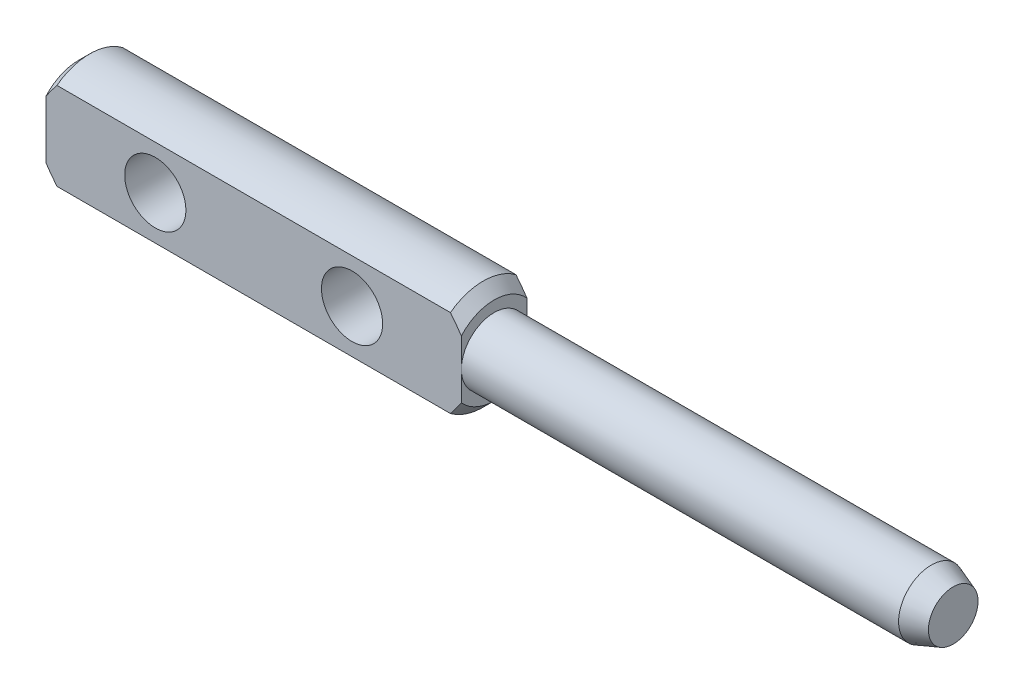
ISO-10303-21;
HEADER;
FILE_DESCRIPTION(('STEP AP214'),'2;1');
FILE_NAME('part.step','',(''),(''),'','','');
FILE_SCHEMA(('AUTOMOTIVE_DESIGN { 1 0 10303 214 1 1 1 1 }'));
ENDSEC;
DATA;
#1=APPLICATION_CONTEXT('core data for automotive mechanical design processes');
#2=APPLICATION_PROTOCOL_DEFINITION('international standard','automotive_design',2000,#1);
#3=PRODUCT_CONTEXT('',#1,'mechanical');
#4=PRODUCT('Part','Part','',(#3));
#5=PRODUCT_RELATED_PRODUCT_CATEGORY('part','',(#4));
#6=PRODUCT_DEFINITION_FORMATION('','',#4);
#7=PRODUCT_DEFINITION_CONTEXT('part definition',#1,'design');
#8=PRODUCT_DEFINITION('design','',#6,#7);
#9=PRODUCT_DEFINITION_SHAPE('','',#8);
#10=(LENGTH_UNIT() NAMED_UNIT(*) SI_UNIT(.MILLI.,.METRE.));
#11=(NAMED_UNIT(*) PLANE_ANGLE_UNIT() SI_UNIT($,.RADIAN.));
#12=(NAMED_UNIT(*) SI_UNIT($,.STERADIAN.) SOLID_ANGLE_UNIT());
#13=UNCERTAINTY_MEASURE_WITH_UNIT(LENGTH_MEASURE(1.E-05),#10,'distance_accuracy_value','');
#14=(GEOMETRIC_REPRESENTATION_CONTEXT(3) GLOBAL_UNCERTAINTY_ASSIGNED_CONTEXT((#13)) GLOBAL_UNIT_ASSIGNED_CONTEXT((#10,
#11,#12)) REPRESENTATION_CONTEXT('',''));
#15=CARTESIAN_POINT('',(0.,0.,0.));
#16=DIRECTION('',(0.,0.,1.));
#17=DIRECTION('',(1.,0.,0.));
#18=AXIS2_PLACEMENT_3D('',#15,#16,#17);
#19=CARTESIAN_POINT('',(0.,0.,0.));
#20=DIRECTION('',(1.,0.,0.));
#21=DIRECTION('',(0.,0.,-1.));
#22=AXIS2_PLACEMENT_3D('',#19,#20,#21);
#23=PLANE('',#22);
#24=DIRECTION('',(0.,1.,0.));
#25=VECTOR('',#24,1.);
#26=CARTESIAN_POINT('',(0.,-2.5,1.5));
#27=LINE('',#26,#25);
#28=CARTESIAN_POINT('',(0.,-1.32287565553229,1.5));
#29=VERTEX_POINT('',#28);
#30=CARTESIAN_POINT('',(0.,1.3228756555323,1.5));
#31=VERTEX_POINT('',#30);
#32=EDGE_CURVE('E159',#29,#31,#27,.T.);
#33=ORIENTED_EDGE('',*,*,#32,.T.);
#34=CARTESIAN_POINT('',(0.,0.,0.));
#35=DIRECTION('',(-1.,0.,0.));
#36=DIRECTION('',(0.,0.,1.));
#37=AXIS2_PLACEMENT_3D('',#34,#35,#36);
#38=CIRCLE('',#37,2.);
#39=CARTESIAN_POINT('',(0.,1.3228756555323,-1.5));
#40=VERTEX_POINT('',#39);
#41=EDGE_CURVE('E12',#31,#40,#38,.T.);
#42=ORIENTED_EDGE('',*,*,#41,.T.);
#43=DIRECTION('',(0.,-1.,0.));
#44=VECTOR('',#43,1.);
#45=CARTESIAN_POINT('',(0.,-2.5,-1.5));
#46=LINE('',#45,#44);
#47=CARTESIAN_POINT('',(0.,-1.3228756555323,-1.5));
#48=VERTEX_POINT('',#47);
#49=EDGE_CURVE('E200',#40,#48,#46,.T.);
#50=ORIENTED_EDGE('',*,*,#49,.T.);
#51=EDGE_CURVE('E43',#48,#29,#38,.T.);
#52=ORIENTED_EDGE('',*,*,#51,.T.);
#53=EDGE_LOOP('',(#33,#42,#50,#52));
#54=FACE_BOUND('',#53,.T.);
#55=ADVANCED_FACE('F36',(#54),#23,.F.);
#56=CARTESIAN_POINT('',(0.5,0.,0.));
#57=DIRECTION('',(1.,0.,0.));
#58=DIRECTION('',(0.,0.,-1.));
#59=AXIS2_PLACEMENT_3D('',#56,#57,#58);
#60=CONICAL_SURFACE('',#59,2.5,0.785398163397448);
#61=CARTESIAN_POINT('',(3.51516268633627,5.30726101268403,1.5));
#62=CARTESIAN_POINT('',(3.41129820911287,5.19932456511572,1.5));
#63=CARTESIAN_POINT('',(3.30755186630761,5.09127425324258,1.5));
#64=CARTESIAN_POINT('',(3.10035188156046,4.87489153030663,1.5));
#65=CARTESIAN_POINT('',(2.9968982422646,4.76655911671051,1.5));
#66=CARTESIAN_POINT('',(2.68699795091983,4.4409908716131,1.5));
#67=CARTESIAN_POINT('',(2.48107825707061,4.22325282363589,1.5));
#68=CARTESIAN_POINT('',(2.07285908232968,3.78735533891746,1.5));
#69=CARTESIAN_POINT('',(1.87054417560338,3.56921041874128,1.5));
#70=CARTESIAN_POINT('',(1.5697300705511,3.2395911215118,1.5));
#71=CARTESIAN_POINT('',(1.4699081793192,3.12932498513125,1.5));
#72=CARTESIAN_POINT('',(1.27145616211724,2.9077267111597,1.5));
#73=CARTESIAN_POINT('',(1.17282600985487,2.79639459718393,1.5));
#74=CARTESIAN_POINT('',(1.00543413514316,2.60463800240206,1.5));
#75=CARTESIAN_POINT('',(0.936267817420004,2.52456708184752,1.5));
#76=CARTESIAN_POINT('',(0.798998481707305,2.36350815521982,1.5));
#77=CARTESIAN_POINT('',(0.7308955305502,2.28252009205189,1.5));
#78=CARTESIAN_POINT('',(0.595778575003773,2.11900885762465,1.5));
#79=CARTESIAN_POINT('',(0.528771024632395,2.03648033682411,1.5));
#80=CARTESIAN_POINT('',(0.396669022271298,1.86991949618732,1.5));
#81=CARTESIAN_POINT('',(0.331574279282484,1.78588740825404,1.5));
#82=CARTESIAN_POINT('',(0.203522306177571,1.6151567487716,1.5));
#83=CARTESIAN_POINT('',(0.140586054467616,1.52844234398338,1.5));
#84=CARTESIAN_POINT('',(0.0185337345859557,1.3522307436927,1.5));
#85=CARTESIAN_POINT('',(-0.0405793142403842,1.2627314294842,1.5));
#86=CARTESIAN_POINT('',(-0.152775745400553,1.08045990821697,1.5));
#87=CARTESIAN_POINT('',(-0.205881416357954,0.987701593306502,1.5));
#88=CARTESIAN_POINT('',(-0.303093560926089,0.79758711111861,1.5));
#89=CARTESIAN_POINT('',(-0.347216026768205,0.700239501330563,1.5));
#90=CARTESIAN_POINT('',(-0.403299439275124,0.549256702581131,1.5));
#91=CARTESIAN_POINT('',(-0.42043059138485,0.497552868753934,1.5));
#92=CARTESIAN_POINT('',(-0.450219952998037,0.392856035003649,1.5));
#93=CARTESIAN_POINT('',(-0.462878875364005,0.339863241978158,1.5));
#94=CARTESIAN_POINT('',(-0.482866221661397,0.233262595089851,1.5));
#95=CARTESIAN_POINT('',(-0.490232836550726,0.179662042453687,1.5));
#96=CARTESIAN_POINT('',(-0.499231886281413,0.0719778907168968,1.5));
#97=CARTESIAN_POINT('',(-0.500865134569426,0.0178943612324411,1.5));
#98=CARTESIAN_POINT('',(-0.498261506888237,-0.0902887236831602,1.5));
#99=CARTESIAN_POINT('',(-0.494007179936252,-0.144387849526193,1.5));
#100=CARTESIAN_POINT('',(-0.479938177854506,-0.251852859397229,1.5));
#101=CARTESIAN_POINT('',(-0.470122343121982,-0.305218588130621,1.5));
#102=CARTESIAN_POINT('',(-0.445517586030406,-0.411215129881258,1.5));
#103=CARTESIAN_POINT('',(-0.430689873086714,-0.463836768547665,1.5));
#104=CARTESIAN_POINT('',(-0.396911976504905,-0.567720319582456,1.5));
#105=CARTESIAN_POINT('',(-0.377961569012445,-0.618982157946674,1.5));
#106=CARTESIAN_POINT('',(-0.332968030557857,-0.729371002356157,1.5));
#107=CARTESIAN_POINT('',(-0.306261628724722,-0.788225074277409,1.5));
#108=CARTESIAN_POINT('',(-0.249281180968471,-0.904194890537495,1.5));
#109=CARTESIAN_POINT('',(-0.219005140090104,-0.961309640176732,1.5));
#110=CARTESIAN_POINT('',(-0.155680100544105,-1.07410361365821,1.5));
#111=CARTESIAN_POINT('',(-0.122626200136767,-1.12978006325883,1.5));
#112=CARTESIAN_POINT('',(-0.0544093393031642,-1.23983114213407,1.5));
#113=CARTESIAN_POINT('',(-0.019245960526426,-1.29420551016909,1.5));
#114=CARTESIAN_POINT('',(0.0894442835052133,-1.45683639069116,1.5));
#115=CARTESIAN_POINT('',(0.165477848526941,-1.56341309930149,1.5));
#116=CARTESIAN_POINT('',(0.321582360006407,-1.77330825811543,1.5));
#117=CARTESIAN_POINT('',(0.401648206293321,-1.87663056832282,1.5));
#118=CARTESIAN_POINT('',(0.543618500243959,-2.05477163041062,1.5));
#119=CARTESIAN_POINT('',(0.604899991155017,-2.13008914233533,1.5));
#120=CARTESIAN_POINT('',(0.728642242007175,-2.27974903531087,1.5));
#121=CARTESIAN_POINT('',(0.791103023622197,-2.354091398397,1.5));
#122=CARTESIAN_POINT('',(0.97986365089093,-2.57598067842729,1.5));
#123=CARTESIAN_POINT('',(1.10752448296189,-2.72236841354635,1.5));
#124=CARTESIAN_POINT('',(1.36529460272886,-3.01325594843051,1.5));
#125=CARTESIAN_POINT('',(1.49540651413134,-3.15775340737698,1.5));
#126=CARTESIAN_POINT('',(1.75719842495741,-3.44529728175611,1.5));
#127=CARTESIAN_POINT('',(1.88887829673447,-3.58834381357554,1.5));
#128=CARTESIAN_POINT('',(2.14434448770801,-3.86368160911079,1.5));
#129=CARTESIAN_POINT('',(2.26805709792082,-3.99604140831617,1.5));
#130=CARTESIAN_POINT('',(2.51621722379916,-4.2600760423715,1.5));
#131=CARTESIAN_POINT('',(2.64066475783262,-4.3917508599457,1.5));
#132=CARTESIAN_POINT('',(2.88987319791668,-4.65430649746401,1.5));
#133=CARTESIAN_POINT('',(3.0146329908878,-4.7851883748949,1.5));
#134=CARTESIAN_POINT('',(3.26459391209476,-5.04652082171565,1.5));
#135=CARTESIAN_POINT('',(3.38979502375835,-5.17697140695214,1.5));
#136=CARTESIAN_POINT('',(3.51516268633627,-5.30726101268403,1.5));
#137=B_SPLINE_CURVE_WITH_KNOTS('',3,(#61,#62,#63,#64,#65,#66,#67,#68,#69,#70,#71,#72,#73,#74,
#75,#76,#77,#78,#79,#80,#81,#82,#83,#84,#85,#86,#87,#88,#89,#90,#91,#92,#93,#94,#95,#96,#97,#98,
#99,#100,#101,#102,#103,#104,#105,#106,#107,#108,#109,#110,#111,#112,#113,#114,#115,#116,#117,
#118,#119,#120,#121,#122,#123,#124,#125,#126,#127,#128,#129,#130,#131,#132,#133,#134,#135,#136),
.UNSPECIFIED.,.F.,.F.,(4,2,2,2,2,2,2,2,2,2,2,2,2,2,2,2,2,2,2,2,2,2,2,2,2,2,2,2,2,2,2,2,2,2,2,2,
2,4),(0.,0.449380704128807,0.898765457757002,1.79782163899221,2.69035548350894,3.13656410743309,
3.58276286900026,3.90017989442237,4.21761678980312,4.53651459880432,4.85536363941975,
5.1767345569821,5.49835625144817,5.81874255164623,6.13855340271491,6.30179762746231,
6.46501581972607,6.6270440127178,6.78904921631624,6.95153563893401,7.11405595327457,
7.27786408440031,7.44168111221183,7.6354096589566,7.82924699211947,8.02343385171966,
8.21765935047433,8.61022782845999,9.00231166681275,9.29359301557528,9.58487972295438,
10.1675355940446,10.7508552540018,11.3341277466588,11.8776457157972,12.4211773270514,
12.9636295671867,13.5060616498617),.UNSPECIFIED.);
#138=CARTESIAN_POINT('',(0.5,2.,1.5));
#139=VERTEX_POINT('',#138);
#140=EDGE_CURVE('E113',#139,#31,#137,.T.);
#141=ORIENTED_EDGE('',*,*,#140,.F.);
#142=CARTESIAN_POINT('',(0.5,0.,0.));
#143=DIRECTION('',(-1.,0.,0.));
#144=DIRECTION('',(0.,0.,1.));
#145=AXIS2_PLACEMENT_3D('',#142,#143,#144);
#146=CIRCLE('',#145,2.5);
#147=CARTESIAN_POINT('',(0.5,2.,-1.5));
#148=VERTEX_POINT('',#147);
#149=EDGE_CURVE('E141',#139,#148,#146,.T.);
#150=ORIENTED_EDGE('',*,*,#149,.T.);
#151=CARTESIAN_POINT('',(3.51516268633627,-5.30726101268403,-1.5));
#152=CARTESIAN_POINT('',(3.41129820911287,-5.19932456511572,-1.5));
#153=CARTESIAN_POINT('',(3.30755186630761,-5.09127425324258,-1.5));
#154=CARTESIAN_POINT('',(3.10035188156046,-4.87489153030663,-1.5));
#155=CARTESIAN_POINT('',(2.9968982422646,-4.76655911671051,-1.5));
#156=CARTESIAN_POINT('',(2.68699795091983,-4.4409908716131,-1.5));
#157=CARTESIAN_POINT('',(2.48107825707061,-4.22325282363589,-1.5));
#158=CARTESIAN_POINT('',(2.07285908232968,-3.78735533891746,-1.5));
#159=CARTESIAN_POINT('',(1.87054417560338,-3.56921041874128,-1.5));
#160=CARTESIAN_POINT('',(1.5697300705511,-3.2395911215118,-1.5));
#161=CARTESIAN_POINT('',(1.4699081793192,-3.12932498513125,-1.5));
#162=CARTESIAN_POINT('',(1.27145616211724,-2.9077267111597,-1.5));
#163=CARTESIAN_POINT('',(1.17282600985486,-2.79639459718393,-1.5));
#164=CARTESIAN_POINT('',(1.00543413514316,-2.60463800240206,-1.5));
#165=CARTESIAN_POINT('',(0.936267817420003,-2.52456708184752,-1.5));
#166=CARTESIAN_POINT('',(0.798998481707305,-2.36350815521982,-1.5));
#167=CARTESIAN_POINT('',(0.730895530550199,-2.28252009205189,-1.5));
#168=CARTESIAN_POINT('',(0.595778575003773,-2.11900885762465,-1.5));
#169=CARTESIAN_POINT('',(0.528771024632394,-2.03648033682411,-1.5));
#170=CARTESIAN_POINT('',(0.396669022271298,-1.86991949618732,-1.5));
#171=CARTESIAN_POINT('',(0.331574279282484,-1.78588740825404,-1.5));
#172=CARTESIAN_POINT('',(0.203522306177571,-1.6151567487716,-1.5));
#173=CARTESIAN_POINT('',(0.140586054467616,-1.52844234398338,-1.5));
#174=CARTESIAN_POINT('',(0.0185337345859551,-1.3522307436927,-1.5));
#175=CARTESIAN_POINT('',(-0.0405793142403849,-1.2627314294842,-1.5));
#176=CARTESIAN_POINT('',(-0.152775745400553,-1.08045990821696,-1.5));
#177=CARTESIAN_POINT('',(-0.205881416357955,-0.987701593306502,-1.5));
#178=CARTESIAN_POINT('',(-0.303093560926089,-0.79758711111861,-1.5));
#179=CARTESIAN_POINT('',(-0.347216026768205,-0.700239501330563,-1.5));
#180=CARTESIAN_POINT('',(-0.403299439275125,-0.549256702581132,-1.5));
#181=CARTESIAN_POINT('',(-0.42043059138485,-0.497552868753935,-1.5));
#182=CARTESIAN_POINT('',(-0.450219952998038,-0.392856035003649,-1.5));
#183=CARTESIAN_POINT('',(-0.462878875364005,-0.339863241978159,-1.5));
#184=CARTESIAN_POINT('',(-0.482866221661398,-0.233262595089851,-1.5));
#185=CARTESIAN_POINT('',(-0.490232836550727,-0.179662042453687,-1.5));
#186=CARTESIAN_POINT('',(-0.499231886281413,-0.0719778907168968,-1.5));
#187=CARTESIAN_POINT('',(-0.500865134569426,-0.0178943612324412,-1.5));
#188=CARTESIAN_POINT('',(-0.498261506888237,0.0902887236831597,-1.5));
#189=CARTESIAN_POINT('',(-0.494007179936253,0.144387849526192,-1.5));
#190=CARTESIAN_POINT('',(-0.479938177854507,0.251852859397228,-1.5));
#191=CARTESIAN_POINT('',(-0.470122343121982,0.30521858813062,-1.5));
#192=CARTESIAN_POINT('',(-0.445517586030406,0.411215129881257,-1.5));
#193=CARTESIAN_POINT('',(-0.430689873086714,0.463836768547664,-1.5));
#194=CARTESIAN_POINT('',(-0.396911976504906,0.567720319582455,-1.5));
#195=CARTESIAN_POINT('',(-0.377961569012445,0.618982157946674,-1.5));
#196=CARTESIAN_POINT('',(-0.332968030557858,0.729371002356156,-1.5));
#197=CARTESIAN_POINT('',(-0.306261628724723,0.788225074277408,-1.5));
#198=CARTESIAN_POINT('',(-0.249281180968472,0.904194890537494,-1.5));
#199=CARTESIAN_POINT('',(-0.219005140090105,0.961309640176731,-1.5));
#200=CARTESIAN_POINT('',(-0.155680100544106,1.07410361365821,-1.5));
#201=CARTESIAN_POINT('',(-0.122626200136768,1.12978006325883,-1.5));
#202=CARTESIAN_POINT('',(-0.054409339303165,1.23983114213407,-1.5));
#203=CARTESIAN_POINT('',(-0.0192459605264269,1.29420551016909,-1.5));
#204=CARTESIAN_POINT('',(0.0894442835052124,1.45683639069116,-1.5));
#205=CARTESIAN_POINT('',(0.16547784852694,1.56341309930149,-1.5));
#206=CARTESIAN_POINT('',(0.321582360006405,1.77330825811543,-1.5));
#207=CARTESIAN_POINT('',(0.401648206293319,1.87663056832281,-1.5));
#208=CARTESIAN_POINT('',(0.543618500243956,2.05477163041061,-1.5));
#209=CARTESIAN_POINT('',(0.604899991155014,2.13008914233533,-1.5));
#210=CARTESIAN_POINT('',(0.728642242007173,2.27974903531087,-1.5));
#211=CARTESIAN_POINT('',(0.791103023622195,2.354091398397,-1.5));
#212=CARTESIAN_POINT('',(0.979863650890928,2.57598067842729,-1.5));
#213=CARTESIAN_POINT('',(1.10752448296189,2.72236841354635,-1.5));
#214=CARTESIAN_POINT('',(1.36529460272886,3.01325594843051,-1.5));
#215=CARTESIAN_POINT('',(1.49540651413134,3.15775340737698,-1.5));
#216=CARTESIAN_POINT('',(1.75719842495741,3.44529728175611,-1.5));
#217=CARTESIAN_POINT('',(1.88887829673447,3.58834381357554,-1.5));
#218=CARTESIAN_POINT('',(2.14434448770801,3.86368160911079,-1.5));
#219=CARTESIAN_POINT('',(2.26805709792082,3.99604140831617,-1.5));
#220=CARTESIAN_POINT('',(2.51621722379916,4.2600760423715,-1.5));
#221=CARTESIAN_POINT('',(2.64066475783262,4.3917508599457,-1.5));
#222=CARTESIAN_POINT('',(2.88987319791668,4.65430649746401,-1.5));
#223=CARTESIAN_POINT('',(3.0146329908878,4.7851883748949,-1.5));
#224=CARTESIAN_POINT('',(3.26459391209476,5.04652082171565,-1.5));
#225=CARTESIAN_POINT('',(3.38979502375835,5.17697140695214,-1.5));
#226=CARTESIAN_POINT('',(3.51516268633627,5.30726101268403,-1.5));
#227=B_SPLINE_CURVE_WITH_KNOTS('',3,(#151,#152,#153,#154,#155,#156,#157,#158,#159,#160,#161,
#162,#163,#164,#165,#166,#167,#168,#169,#170,#171,#172,#173,#174,#175,#176,#177,#178,#179,#180,
#181,#182,#183,#184,#185,#186,#187,#188,#189,#190,#191,#192,#193,#194,#195,#196,#197,#198,#199,
#200,#201,#202,#203,#204,#205,#206,#207,#208,#209,#210,#211,#212,#213,#214,#215,#216,#217,#218,
#219,#220,#221,#222,#223,#224,#225,#226),.UNSPECIFIED.,.F.,.F.,(4,2,2,2,2,2,2,2,2,2,2,2,2,2,2,2,
2,2,2,2,2,2,2,2,2,2,2,2,2,2,2,2,2,2,2,2,2,4),(0.,0.449380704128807,0.898765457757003,
1.79782163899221,2.69035548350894,3.13656410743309,3.58276286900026,3.90017989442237,
4.21761678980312,4.53651459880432,4.85536363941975,5.1767345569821,5.49835625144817,
5.81874255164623,6.1385534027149,6.30179762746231,6.46501581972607,6.6270440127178,
6.78904921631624,6.951535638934,7.11405595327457,7.27786408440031,7.44168111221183,
7.6354096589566,7.82924699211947,8.02343385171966,8.21765935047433,8.61022782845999,
9.00231166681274,9.29359301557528,9.58487972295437,10.1675355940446,10.7508552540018,
11.3341277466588,11.8776457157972,12.4211773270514,12.9636295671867,13.5060616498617),.UNSPECIFIED.);
#228=EDGE_CURVE('E203',#40,#148,#227,.T.);
#229=ORIENTED_EDGE('',*,*,#228,.F.);
#230=ORIENTED_EDGE('',*,*,#41,.F.);
#231=EDGE_LOOP('',(#141,#150,#229,#230));
#232=FACE_BOUND('',#231,.T.);
#233=ADVANCED_FACE('F193',(#232),#60,.T.);
#234=CARTESIAN_POINT('',(0.5,-2.,1.5));
#235=VERTEX_POINT('',#234);
#236=EDGE_CURVE('E154',#29,#235,#137,.T.);
#237=ORIENTED_EDGE('',*,*,#236,.F.);
#238=ORIENTED_EDGE('',*,*,#51,.F.);
#239=CARTESIAN_POINT('',(0.5,-2.,-1.5));
#240=VERTEX_POINT('',#239);
#241=EDGE_CURVE('E155',#240,#48,#227,.T.);
#242=ORIENTED_EDGE('',*,*,#241,.F.);
#243=EDGE_CURVE('E140',#240,#235,#146,.T.);
#244=ORIENTED_EDGE('',*,*,#243,.T.);
#245=EDGE_LOOP('',(#237,#238,#242,#244));
#246=FACE_BOUND('',#245,.T.);
#247=ADVANCED_FACE('F152',(#246),#60,.T.);
#248=CARTESIAN_POINT('',(0.,0.,0.));
#249=DIRECTION('',(-1.,0.,0.));
#250=DIRECTION('',(0.,0.,1.));
#251=AXIS2_PLACEMENT_3D('',#248,#249,#250);
#252=CYLINDRICAL_SURFACE('',#251,2.5);
#253=CARTESIAN_POINT('',(18.5,0.,0.));
#254=DIRECTION('',(-1.,0.,0.));
#255=DIRECTION('',(0.,0.,1.));
#256=AXIS2_PLACEMENT_3D('',#253,#254,#255);
#257=CIRCLE('',#256,2.5);
#258=CARTESIAN_POINT('',(18.5,-2.,-1.5));
#259=VERTEX_POINT('',#258);
#260=CARTESIAN_POINT('',(18.4999999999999,-2.00000000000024,1.5));
#261=VERTEX_POINT('',#260);
#262=EDGE_CURVE('E134',#259,#261,#257,.T.);
#263=ORIENTED_EDGE('',*,*,#262,.T.);
#264=DIRECTION('',(-1.,0.,0.));
#265=VECTOR('',#264,1.);
#266=CARTESIAN_POINT('',(0.,-2.,1.5));
#267=LINE('',#266,#265);
#268=EDGE_CURVE('E109',#235,#261,#267,.F.);
#269=ORIENTED_EDGE('',*,*,#268,.F.);
#270=ORIENTED_EDGE('',*,*,#243,.F.);
#271=DIRECTION('',(-1.,0.,0.));
#272=VECTOR('',#271,1.);
#273=CARTESIAN_POINT('',(0.,-2.,-1.5));
#274=LINE('',#273,#272);
#275=EDGE_CURVE('E215',#259,#240,#274,.T.);
#276=ORIENTED_EDGE('',*,*,#275,.F.);
#277=EDGE_LOOP('',(#263,#269,#270,#276));
#278=FACE_BOUND('',#277,.T.);
#279=ADVANCED_FACE('F162',(#278),#252,.T.);
#280=DIRECTION('',(-1.,0.,0.));
#281=VECTOR('',#280,1.);
#282=CARTESIAN_POINT('',(0.,2.,-1.5));
#283=LINE('',#282,#281);
#284=CARTESIAN_POINT('',(18.4999999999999,2.00000000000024,-1.5));
#285=VERTEX_POINT('',#284);
#286=EDGE_CURVE('E206',#148,#285,#283,.F.);
#287=ORIENTED_EDGE('',*,*,#286,.F.);
#288=ORIENTED_EDGE('',*,*,#149,.F.);
#289=DIRECTION('',(-1.,0.,0.));
#290=VECTOR('',#289,1.);
#291=CARTESIAN_POINT('',(0.,2.,1.5));
#292=LINE('',#291,#290);
#293=CARTESIAN_POINT('',(18.5,2.,1.5));
#294=VERTEX_POINT('',#293);
#295=EDGE_CURVE('E208',#294,#139,#292,.T.);
#296=ORIENTED_EDGE('',*,*,#295,.F.);
#297=EDGE_CURVE('E139',#294,#285,#257,.T.);
#298=ORIENTED_EDGE('',*,*,#297,.T.);
#299=EDGE_LOOP('',(#287,#288,#296,#298));
#300=FACE_BOUND('',#299,.T.);
#301=ADVANCED_FACE('F241',(#300),#252,.T.);
#302=CARTESIAN_POINT('',(19.,0.,0.));
#303=DIRECTION('',(-1.,0.,0.));
#304=DIRECTION('',(0.,0.,1.));
#305=AXIS2_PLACEMENT_3D('',#302,#303,#304);
#306=CONICAL_SURFACE('',#305,2.,0.785398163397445);
#307=CARTESIAN_POINT('',(15.4848373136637,-5.307261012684,1.5));
#308=CARTESIAN_POINT('',(15.5887017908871,-5.19932456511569,1.5));
#309=CARTESIAN_POINT('',(15.6924481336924,-5.09127425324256,1.5));
#310=CARTESIAN_POINT('',(15.8996481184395,-4.87489153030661,1.5));
#311=CARTESIAN_POINT('',(16.0031017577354,-4.76655911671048,1.5));
#312=CARTESIAN_POINT('',(16.3130020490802,-4.44099087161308,1.5));
#313=CARTESIAN_POINT('',(16.5189217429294,-4.22325282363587,1.5));
#314=CARTESIAN_POINT('',(16.9271409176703,-3.78735533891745,1.5));
#315=CARTESIAN_POINT('',(17.1294558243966,-3.56921041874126,1.5));
#316=CARTESIAN_POINT('',(17.4302699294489,-3.23959112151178,1.5));
#317=CARTESIAN_POINT('',(17.5300918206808,-3.12932498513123,1.5));
#318=CARTESIAN_POINT('',(17.7285438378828,-2.90772671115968,1.5));
#319=CARTESIAN_POINT('',(17.8271739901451,-2.79639459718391,1.5));
#320=CARTESIAN_POINT('',(17.9945658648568,-2.60463800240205,1.5));
#321=CARTESIAN_POINT('',(18.06373218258,-2.52456708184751,1.5));
#322=CARTESIAN_POINT('',(18.2010015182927,-2.36350815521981,1.5));
#323=CARTESIAN_POINT('',(18.2691044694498,-2.28252009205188,1.5));
#324=CARTESIAN_POINT('',(18.4042214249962,-2.11900885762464,1.5));
#325=CARTESIAN_POINT('',(18.4712289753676,-2.0364803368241,1.5));
#326=CARTESIAN_POINT('',(18.6033309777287,-1.86991949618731,1.5));
#327=CARTESIAN_POINT('',(18.6684257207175,-1.78588740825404,1.5));
#328=CARTESIAN_POINT('',(18.7964776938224,-1.6151567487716,1.5));
#329=CARTESIAN_POINT('',(18.8594139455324,-1.52844234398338,1.5));
#330=CARTESIAN_POINT('',(18.981466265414,-1.3522307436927,1.5));
#331=CARTESIAN_POINT('',(19.0405793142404,-1.2627314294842,1.5));
#332=CARTESIAN_POINT('',(19.1527757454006,-1.08045990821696,1.5));
#333=CARTESIAN_POINT('',(19.205881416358,-0.987701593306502,1.5));
#334=CARTESIAN_POINT('',(19.3030935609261,-0.797587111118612,1.5));
#335=CARTESIAN_POINT('',(19.3472160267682,-0.700239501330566,1.5));
#336=CARTESIAN_POINT('',(19.4032994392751,-0.549256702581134,1.5));
#337=CARTESIAN_POINT('',(19.4204305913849,-0.497552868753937,1.5));
#338=CARTESIAN_POINT('',(19.450219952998,-0.392856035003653,1.5));
#339=CARTESIAN_POINT('',(19.462878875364,-0.339863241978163,1.5));
#340=CARTESIAN_POINT('',(19.4828662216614,-0.233262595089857,1.5));
#341=CARTESIAN_POINT('',(19.4902328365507,-0.179662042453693,1.5));
#342=CARTESIAN_POINT('',(19.4992318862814,-0.0719778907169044,1.5));
#343=CARTESIAN_POINT('',(19.5008651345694,-0.0178943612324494,1.5));
#344=CARTESIAN_POINT('',(19.4982615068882,0.0902887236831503,1.5));
#345=CARTESIAN_POINT('',(19.4940071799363,0.144387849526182,1.5));
#346=CARTESIAN_POINT('',(19.4799381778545,0.251852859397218,1.5));
#347=CARTESIAN_POINT('',(19.470122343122,0.30521858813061,1.5));
#348=CARTESIAN_POINT('',(19.4455175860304,0.411215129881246,1.5));
#349=CARTESIAN_POINT('',(19.4306898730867,0.463836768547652,1.5));
#350=CARTESIAN_POINT('',(19.3969119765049,0.567720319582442,1.5));
#351=CARTESIAN_POINT('',(19.3779615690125,0.618982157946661,1.5));
#352=CARTESIAN_POINT('',(19.3329680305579,0.729371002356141,1.5));
#353=CARTESIAN_POINT('',(19.3062616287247,0.788225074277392,1.5));
#354=CARTESIAN_POINT('',(19.2492811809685,0.904194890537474,1.5));
#355=CARTESIAN_POINT('',(19.2190051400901,0.961309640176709,1.5));
#356=CARTESIAN_POINT('',(19.1556801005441,1.07410361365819,1.5));
#357=CARTESIAN_POINT('',(19.1226262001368,1.1297800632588,1.5));
#358=CARTESIAN_POINT('',(19.0544093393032,1.23983114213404,1.5));
#359=CARTESIAN_POINT('',(19.0192459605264,1.29420551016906,1.5));
#360=CARTESIAN_POINT('',(18.9105557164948,1.45683639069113,1.5));
#361=CARTESIAN_POINT('',(18.8345221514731,1.56341309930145,1.5));
#362=CARTESIAN_POINT('',(18.6784176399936,1.77330825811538,1.5));
#363=CARTESIAN_POINT('',(18.5983517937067,1.87663056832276,1.5));
#364=CARTESIAN_POINT('',(18.4563814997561,2.05477163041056,1.5));
#365=CARTESIAN_POINT('',(18.395100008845,2.13008914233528,1.5));
#366=CARTESIAN_POINT('',(18.2713577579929,2.27974903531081,1.5));
#367=CARTESIAN_POINT('',(18.2088969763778,2.35409139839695,1.5));
#368=CARTESIAN_POINT('',(18.0201363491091,2.57598067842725,1.5));
#369=CARTESIAN_POINT('',(17.8924755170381,2.72236841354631,1.5));
#370=CARTESIAN_POINT('',(17.6347053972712,3.01325594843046,1.5));
#371=CARTESIAN_POINT('',(17.5045934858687,3.15775340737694,1.5));
#372=CARTESIAN_POINT('',(17.2428015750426,3.44529728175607,1.5));
#373=CARTESIAN_POINT('',(17.1111217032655,3.58834381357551,1.5));
#374=CARTESIAN_POINT('',(16.855655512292,3.86368160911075,1.5));
#375=CARTESIAN_POINT('',(16.7319429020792,3.99604140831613,1.5));
#376=CARTESIAN_POINT('',(16.4837827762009,4.26007604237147,1.5));
#377=CARTESIAN_POINT('',(16.3593352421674,4.39175085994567,1.5));
#378=CARTESIAN_POINT('',(16.1101268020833,4.65430649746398,1.5));
#379=CARTESIAN_POINT('',(15.9853670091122,4.78518837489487,1.5));
#380=CARTESIAN_POINT('',(15.7354060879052,5.04652082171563,1.5));
#381=CARTESIAN_POINT('',(15.6102049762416,5.17697140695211,1.5));
#382=CARTESIAN_POINT('',(15.4848373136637,5.307261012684,1.5));
#383=B_SPLINE_CURVE_WITH_KNOTS('',3,(#307,#308,#309,#310,#311,#312,#313,#314,#315,#316,#317,
#318,#319,#320,#321,#322,#323,#324,#325,#326,#327,#328,#329,#330,#331,#332,#333,#334,#335,#336,
#337,#338,#339,#340,#341,#342,#343,#344,#345,#346,#347,#348,#349,#350,#351,#352,#353,#354,#355,
#356,#357,#358,#359,#360,#361,#362,#363,#364,#365,#366,#367,#368,#369,#370,#371,#372,#373,#374,
#375,#376,#377,#378,#379,#380,#381,#382),.UNSPECIFIED.,.F.,.F.,(4,2,2,2,2,2,2,2,2,2,2,2,2,2,2,2,
2,2,2,2,2,2,2,2,2,2,2,2,2,2,2,2,2,2,2,2,2,4),(0.,0.449380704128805,0.898765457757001,
1.79782163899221,2.69035548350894,3.13656410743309,3.58276286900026,3.90017989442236,
4.21761678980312,4.53651459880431,4.85536363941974,5.17673455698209,5.49835625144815,
5.81874255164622,6.13855340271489,6.30179762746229,6.46501581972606,6.62704401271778,
6.78904921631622,6.95153563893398,7.11405595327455,7.27786408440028,7.4416811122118,
7.63540965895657,7.82924699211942,8.02343385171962,8.21765935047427,8.61022782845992,
9.00231166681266,9.2935930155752,9.5848797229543,10.1675355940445,10.7508552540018,
11.3341277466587,11.8776457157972,12.4211773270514,12.9636295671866,13.5060616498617),.UNSPECIFIED.);
#384=CARTESIAN_POINT('',(19.,-1.32287565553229,1.5));
#385=VERTEX_POINT('',#384);
#386=EDGE_CURVE('E105',#261,#385,#383,.T.);
#387=ORIENTED_EDGE('',*,*,#386,.F.);
#388=ORIENTED_EDGE('',*,*,#262,.F.);
#389=CARTESIAN_POINT('',(15.4848373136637,5.307261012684,-1.5));
#390=CARTESIAN_POINT('',(15.5887017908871,5.19932456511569,-1.5));
#391=CARTESIAN_POINT('',(15.6924481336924,5.09127425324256,-1.5));
#392=CARTESIAN_POINT('',(15.8996481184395,4.87489153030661,-1.5));
#393=CARTESIAN_POINT('',(16.0031017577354,4.76655911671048,-1.5));
#394=CARTESIAN_POINT('',(16.3130020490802,4.44099087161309,-1.5));
#395=CARTESIAN_POINT('',(16.5189217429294,4.22325282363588,-1.5));
#396=CARTESIAN_POINT('',(16.9271409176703,3.78735533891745,-1.5));
#397=CARTESIAN_POINT('',(17.1294558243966,3.56921041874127,-1.5));
#398=CARTESIAN_POINT('',(17.4302699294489,3.23959112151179,-1.5));
#399=CARTESIAN_POINT('',(17.5300918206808,3.12932498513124,-1.5));
#400=CARTESIAN_POINT('',(17.7285438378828,2.90772671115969,-1.5));
#401=CARTESIAN_POINT('',(17.8271739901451,2.79639459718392,-1.5));
#402=CARTESIAN_POINT('',(17.9945658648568,2.60463800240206,-1.5));
#403=CARTESIAN_POINT('',(18.06373218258,2.52456708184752,-1.5));
#404=CARTESIAN_POINT('',(18.2010015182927,2.36350815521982,-1.5));
#405=CARTESIAN_POINT('',(18.2691044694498,2.28252009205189,-1.5));
#406=CARTESIAN_POINT('',(18.4042214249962,2.11900885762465,-1.5));
#407=CARTESIAN_POINT('',(18.4712289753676,2.03648033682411,-1.5));
#408=CARTESIAN_POINT('',(18.6033309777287,1.86991949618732,-1.5));
#409=CARTESIAN_POINT('',(18.6684257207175,1.78588740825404,-1.5));
#410=CARTESIAN_POINT('',(18.7964776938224,1.61515674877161,-1.5));
#411=CARTESIAN_POINT('',(18.8594139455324,1.52844234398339,-1.5));
#412=CARTESIAN_POINT('',(18.981466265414,1.35223074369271,-1.5));
#413=CARTESIAN_POINT('',(19.0405793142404,1.26273142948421,-1.5));
#414=CARTESIAN_POINT('',(19.1527757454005,1.08045990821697,-1.5));
#415=CARTESIAN_POINT('',(19.205881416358,0.987701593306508,-1.5));
#416=CARTESIAN_POINT('',(19.3030935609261,0.797587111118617,-1.5));
#417=CARTESIAN_POINT('',(19.3472160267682,0.700239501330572,-1.5));
#418=CARTESIAN_POINT('',(19.4032994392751,0.549256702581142,-1.5));
#419=CARTESIAN_POINT('',(19.4204305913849,0.497552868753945,-1.5));
#420=CARTESIAN_POINT('',(19.450219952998,0.39285603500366,-1.5));
#421=CARTESIAN_POINT('',(19.462878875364,0.33986324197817,-1.5));
#422=CARTESIAN_POINT('',(19.4828662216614,0.233262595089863,-1.5));
#423=CARTESIAN_POINT('',(19.4902328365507,0.179662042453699,-1.5));
#424=CARTESIAN_POINT('',(19.4992318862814,0.0719778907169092,-1.5));
#425=CARTESIAN_POINT('',(19.5008651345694,0.0178943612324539,-1.5));
#426=CARTESIAN_POINT('',(19.4982615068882,-0.0902887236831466,-1.5));
#427=CARTESIAN_POINT('',(19.4940071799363,-0.144387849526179,-1.5));
#428=CARTESIAN_POINT('',(19.4799381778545,-0.251852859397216,-1.5));
#429=CARTESIAN_POINT('',(19.470122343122,-0.305218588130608,-1.5));
#430=CARTESIAN_POINT('',(19.4455175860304,-0.411215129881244,-1.5));
#431=CARTESIAN_POINT('',(19.4306898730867,-0.463836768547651,-1.5));
#432=CARTESIAN_POINT('',(19.3969119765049,-0.567720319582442,-1.5));
#433=CARTESIAN_POINT('',(19.3779615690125,-0.61898215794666,-1.5));
#434=CARTESIAN_POINT('',(19.3329680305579,-0.729371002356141,-1.5));
#435=CARTESIAN_POINT('',(19.3062616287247,-0.788225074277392,-1.5));
#436=CARTESIAN_POINT('',(19.2492811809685,-0.904194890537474,-1.5));
#437=CARTESIAN_POINT('',(19.2190051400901,-0.961309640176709,-1.5));
#438=CARTESIAN_POINT('',(19.1556801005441,-1.07410361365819,-1.5));
#439=CARTESIAN_POINT('',(19.1226262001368,-1.1297800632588,-1.5));
#440=CARTESIAN_POINT('',(19.0544093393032,-1.23983114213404,-1.5));
#441=CARTESIAN_POINT('',(19.0192459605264,-1.29420551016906,-1.5));
#442=CARTESIAN_POINT('',(18.9105557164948,-1.45683639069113,-1.5));
#443=CARTESIAN_POINT('',(18.8345221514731,-1.56341309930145,-1.5));
#444=CARTESIAN_POINT('',(18.6784176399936,-1.77330825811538,-1.5));
#445=CARTESIAN_POINT('',(18.5983517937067,-1.87663056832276,-1.5));
#446=CARTESIAN_POINT('',(18.4563814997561,-2.05477163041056,-1.5));
#447=CARTESIAN_POINT('',(18.395100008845,-2.13008914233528,-1.5));
#448=CARTESIAN_POINT('',(18.2713577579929,-2.27974903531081,-1.5));
#449=CARTESIAN_POINT('',(18.2088969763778,-2.35409139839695,-1.5));
#450=CARTESIAN_POINT('',(18.0201363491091,-2.57598067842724,-1.5));
#451=CARTESIAN_POINT('',(17.8924755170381,-2.7223684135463,-1.5));
#452=CARTESIAN_POINT('',(17.6347053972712,-3.01325594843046,-1.5));
#453=CARTESIAN_POINT('',(17.5045934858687,-3.15775340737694,-1.5));
#454=CARTESIAN_POINT('',(17.2428015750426,-3.44529728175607,-1.5));
#455=CARTESIAN_POINT('',(17.1111217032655,-3.5883438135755,-1.5));
#456=CARTESIAN_POINT('',(16.855655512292,-3.86368160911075,-1.5));
#457=CARTESIAN_POINT('',(16.7319429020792,-3.99604140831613,-1.5));
#458=CARTESIAN_POINT('',(16.4837827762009,-4.26007604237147,-1.5));
#459=CARTESIAN_POINT('',(16.3593352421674,-4.39175085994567,-1.5));
#460=CARTESIAN_POINT('',(16.1101268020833,-4.65430649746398,-1.5));
#461=CARTESIAN_POINT('',(15.9853670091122,-4.78518837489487,-1.5));
#462=CARTESIAN_POINT('',(15.7354060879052,-5.04652082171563,-1.5));
#463=CARTESIAN_POINT('',(15.6102049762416,-5.17697140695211,-1.5));
#464=CARTESIAN_POINT('',(15.4848373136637,-5.307261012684,-1.5));
#465=B_SPLINE_CURVE_WITH_KNOTS('',3,(#389,#390,#391,#392,#393,#394,#395,#396,#397,#398,#399,
#400,#401,#402,#403,#404,#405,#406,#407,#408,#409,#410,#411,#412,#413,#414,#415,#416,#417,#418,
#419,#420,#421,#422,#423,#424,#425,#426,#427,#428,#429,#430,#431,#432,#433,#434,#435,#436,#437,
#438,#439,#440,#441,#442,#443,#444,#445,#446,#447,#448,#449,#450,#451,#452,#453,#454,#455,#456,
#457,#458,#459,#460,#461,#462,#463,#464),.UNSPECIFIED.,.F.,.F.,(4,2,2,2,2,2,2,2,2,2,2,2,2,2,2,2,
2,2,2,2,2,2,2,2,2,2,2,2,2,2,2,2,2,2,2,2,2,4),(0.,0.449380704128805,0.898765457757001,
1.7978216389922,2.69035548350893,3.13656410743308,3.58276286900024,3.90017989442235,
4.2176167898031,4.5365145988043,4.85536363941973,5.17673455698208,5.49835625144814,
5.81874255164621,6.13855340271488,6.30179762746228,6.46501581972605,6.62704401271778,
6.78904921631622,6.95153563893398,7.11405595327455,7.27786408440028,7.4416811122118,
7.63540965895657,7.82924699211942,8.02343385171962,8.21765935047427,8.61022782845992,
9.00231166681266,9.2935930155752,9.5848797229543,10.1675355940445,10.7508552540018,
11.3341277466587,11.8776457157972,12.4211773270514,12.9636295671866,13.5060616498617),.UNSPECIFIED.);
#466=CARTESIAN_POINT('',(19.,-1.32287565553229,-1.5));
#467=VERTEX_POINT('',#466);
#468=EDGE_CURVE('E129',#467,#259,#465,.T.);
#469=ORIENTED_EDGE('',*,*,#468,.F.);
#470=CARTESIAN_POINT('',(19.,0.,0.));
#471=DIRECTION('',(-1.,0.,0.));
#472=DIRECTION('',(0.,0.,1.));
#473=AXIS2_PLACEMENT_3D('',#470,#471,#472);
#474=CIRCLE('',#473,2.);
#475=EDGE_CURVE('E120',#467,#385,#474,.T.);
#476=ORIENTED_EDGE('',*,*,#475,.T.);
#477=EDGE_LOOP('',(#387,#388,#469,#476));
#478=FACE_BOUND('',#477,.T.);
#479=ADVANCED_FACE('F128',(#478),#306,.T.);
#480=CARTESIAN_POINT('',(19.,1.32287565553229,1.5));
#481=VERTEX_POINT('',#480);
#482=EDGE_CURVE('E115',#481,#294,#383,.T.);
#483=ORIENTED_EDGE('',*,*,#482,.F.);
#484=CARTESIAN_POINT('',(19.,1.32287565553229,-1.5));
#485=VERTEX_POINT('',#484);
#486=EDGE_CURVE('E130',#481,#485,#474,.T.);
#487=ORIENTED_EDGE('',*,*,#486,.T.);
#488=EDGE_CURVE('E209',#285,#485,#465,.T.);
#489=ORIENTED_EDGE('',*,*,#488,.F.);
#490=ORIENTED_EDGE('',*,*,#297,.F.);
#491=EDGE_LOOP('',(#483,#487,#489,#490));
#492=FACE_BOUND('',#491,.T.);
#493=ADVANCED_FACE('F244',(#492),#306,.T.);
#494=CARTESIAN_POINT('',(19.,2.,0.));
#495=DIRECTION('',(-1.,0.,0.));
#496=DIRECTION('',(0.,0.,1.));
#497=AXIS2_PLACEMENT_3D('',#494,#495,#496);
#498=PLANE('',#497);
#499=DIRECTION('',(0.,1.,0.));
#500=VECTOR('',#499,1.);
#501=CARTESIAN_POINT('',(19.,-2.5,1.5));
#502=LINE('',#501,#500);
#503=CARTESIAN_POINT('',(19.,0.,1.5));
#504=VERTEX_POINT('',#503);
#505=EDGE_CURVE('E58',#385,#504,#502,.T.);
#506=ORIENTED_EDGE('',*,*,#505,.F.);
#507=ORIENTED_EDGE('',*,*,#475,.F.);
#508=DIRECTION('',(0.,-1.,0.));
#509=VECTOR('',#508,1.);
#510=CARTESIAN_POINT('',(19.,-2.5,-1.5));
#511=LINE('',#510,#509);
#512=CARTESIAN_POINT('',(19.,0.,-1.5));
#513=VERTEX_POINT('',#512);
#514=EDGE_CURVE('E124',#513,#467,#511,.T.);
#515=ORIENTED_EDGE('',*,*,#514,.F.);
#516=CARTESIAN_POINT('',(19.,0.,0.));
#517=DIRECTION('',(-1.,0.,0.));
#518=DIRECTION('',(0.,0.,1.));
#519=AXIS2_PLACEMENT_3D('',#516,#517,#518);
#520=CIRCLE('',#519,1.5);
#521=EDGE_CURVE('E122',#513,#504,#520,.T.);
#522=ORIENTED_EDGE('',*,*,#521,.T.);
#523=EDGE_LOOP('',(#506,#507,#515,#522));
#524=FACE_BOUND('',#523,.T.);
#525=ADVANCED_FACE('F119',(#524),#498,.F.);
#526=EDGE_CURVE('E125',#504,#481,#502,.T.);
#527=ORIENTED_EDGE('',*,*,#526,.F.);
#528=EDGE_CURVE('E131',#504,#513,#520,.T.);
#529=ORIENTED_EDGE('',*,*,#528,.T.);
#530=EDGE_CURVE('E50',#485,#513,#511,.T.);
#531=ORIENTED_EDGE('',*,*,#530,.F.);
#532=ORIENTED_EDGE('',*,*,#486,.F.);
#533=EDGE_LOOP('',(#527,#529,#531,#532));
#534=FACE_BOUND('',#533,.T.);
#535=ADVANCED_FACE('F247',(#534),#498,.F.);
#536=CARTESIAN_POINT('',(0.,0.,0.));
#537=DIRECTION('',(-1.,0.,0.));
#538=DIRECTION('',(0.,0.,1.));
#539=AXIS2_PLACEMENT_3D('',#536,#537,#538);
#540=CYLINDRICAL_SURFACE('',#539,1.5);
#541=ORIENTED_EDGE('',*,*,#528,.F.);
#542=ORIENTED_EDGE('',*,*,#521,.F.);
#543=EDGE_LOOP('',(#541,#542));
#544=FACE_BOUND('',#543,.T.);
#545=CARTESIAN_POINT('',(39.,0.,0.));
#546=DIRECTION('',(-1.,0.,0.));
#547=DIRECTION('',(0.,0.,1.));
#548=AXIS2_PLACEMENT_3D('',#545,#546,#547);
#549=CIRCLE('',#548,1.5);
#550=CARTESIAN_POINT('',(39.,0.,1.5));
#551=VERTEX_POINT('',#550);
#552=EDGE_CURVE('E171',#551,#551,#549,.T.);
#553=ORIENTED_EDGE('',*,*,#552,.T.);
#554=EDGE_LOOP('',(#553));
#555=FACE_BOUND('',#554,.T.);
#556=ADVANCED_FACE('F175',(#544,#555),#540,.T.);
#557=CARTESIAN_POINT('',(40.,0.,0.));
#558=DIRECTION('',(-1.,0.,0.));
#559=DIRECTION('',(0.,0.,1.));
#560=AXIS2_PLACEMENT_3D('',#557,#558,#559);
#561=CONICAL_SURFACE('',#560,1.1360297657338,0.349065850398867);
#562=ORIENTED_EDGE('',*,*,#552,.F.);
#563=EDGE_LOOP('',(#562));
#564=FACE_BOUND('',#563,.T.);
#565=CARTESIAN_POINT('',(40.,0.,0.));
#566=DIRECTION('',(-1.,0.,0.));
#567=DIRECTION('',(0.,0.,1.));
#568=AXIS2_PLACEMENT_3D('',#565,#566,#567);
#569=CIRCLE('',#568,1.1360297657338);
#570=CARTESIAN_POINT('',(40.,0.,1.1360297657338));
#571=VERTEX_POINT('',#570);
#572=EDGE_CURVE('E160',#571,#571,#569,.T.);
#573=ORIENTED_EDGE('',*,*,#572,.T.);
#574=EDGE_LOOP('',(#573));
#575=FACE_BOUND('',#574,.T.);
#576=ADVANCED_FACE('F177',(#564,#575),#561,.T.);
#577=CARTESIAN_POINT('',(40.,1.1360297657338,0.));
#578=DIRECTION('',(-1.,0.,0.));
#579=DIRECTION('',(0.,0.,1.));
#580=AXIS2_PLACEMENT_3D('',#577,#578,#579);
#581=PLANE('',#580);
#582=ORIENTED_EDGE('',*,*,#572,.F.);
#583=EDGE_LOOP('',(#582));
#584=FACE_BOUND('',#583,.T.);
#585=ADVANCED_FACE('F180',(#584),#581,.F.);
#586=CARTESIAN_POINT('',(19.,-2.5,-1.5));
#587=DIRECTION('',(0.,0.,-1.));
#588=DIRECTION('',(-1.,0.,0.));
#589=AXIS2_PLACEMENT_3D('',#586,#587,#588);
#590=PLANE('',#589);
#591=CARTESIAN_POINT('',(14.,0.,-1.5));
#592=DIRECTION('',(0.,0.,1.));
#593=DIRECTION('',(1.,0.,0.));
#594=AXIS2_PLACEMENT_3D('',#591,#592,#593);
#595=CIRCLE('',#594,1.4);
#596=CARTESIAN_POINT('',(15.4,0.,-1.5));
#597=VERTEX_POINT('',#596);
#598=EDGE_CURVE('E253',#597,#597,#595,.T.);
#599=ORIENTED_EDGE('',*,*,#598,.T.);
#600=EDGE_LOOP('',(#599));
#601=FACE_BOUND('',#600,.T.);
#602=CARTESIAN_POINT('',(5.,0.,-1.5));
#603=DIRECTION('',(0.,0.,1.));
#604=DIRECTION('',(1.,0.,0.));
#605=AXIS2_PLACEMENT_3D('',#602,#603,#604);
#606=CIRCLE('',#605,1.4);
#607=CARTESIAN_POINT('',(6.4,0.,-1.5));
#608=VERTEX_POINT('',#607);
#609=EDGE_CURVE('E201',#608,#608,#606,.T.);
#610=ORIENTED_EDGE('',*,*,#609,.T.);
#611=EDGE_LOOP('',(#610));
#612=FACE_BOUND('',#611,.T.);
#613=ORIENTED_EDGE('',*,*,#228,.T.);
#614=ORIENTED_EDGE('',*,*,#286,.T.);
#615=ORIENTED_EDGE('',*,*,#488,.T.);
#616=ORIENTED_EDGE('',*,*,#530,.T.);
#617=ORIENTED_EDGE('',*,*,#514,.T.);
#618=ORIENTED_EDGE('',*,*,#468,.T.);
#619=ORIENTED_EDGE('',*,*,#275,.T.);
#620=ORIENTED_EDGE('',*,*,#241,.T.);
#621=ORIENTED_EDGE('',*,*,#49,.F.);
#622=EDGE_LOOP('',(#613,#614,#615,#616,#617,#618,#619,#620,#621));
#623=FACE_BOUND('',#622,.T.);
#624=ADVANCED_FACE('F185',(#601,#612,#623),#590,.T.);
#625=CARTESIAN_POINT('',(19.,-2.5,1.5));
#626=DIRECTION('',(0.,0.,1.));
#627=DIRECTION('',(1.,0.,0.));
#628=AXIS2_PLACEMENT_3D('',#625,#626,#627);
#629=PLANE('',#628);
#630=CARTESIAN_POINT('',(14.,0.,1.5));
#631=DIRECTION('',(0.,0.,1.));
#632=DIRECTION('',(1.,0.,0.));
#633=AXIS2_PLACEMENT_3D('',#630,#631,#632);
#634=CIRCLE('',#633,1.4);
#635=CARTESIAN_POINT('',(15.4,0.,1.5));
#636=VERTEX_POINT('',#635);
#637=EDGE_CURVE('E256',#636,#636,#634,.T.);
#638=ORIENTED_EDGE('',*,*,#637,.F.);
#639=EDGE_LOOP('',(#638));
#640=FACE_BOUND('',#639,.T.);
#641=CARTESIAN_POINT('',(5.,0.,1.5));
#642=DIRECTION('',(0.,0.,1.));
#643=DIRECTION('',(1.,0.,0.));
#644=AXIS2_PLACEMENT_3D('',#641,#642,#643);
#645=CIRCLE('',#644,1.4);
#646=CARTESIAN_POINT('',(6.4,0.,1.5));
#647=VERTEX_POINT('',#646);
#648=EDGE_CURVE('E250',#647,#647,#645,.T.);
#649=ORIENTED_EDGE('',*,*,#648,.F.);
#650=EDGE_LOOP('',(#649));
#651=FACE_BOUND('',#650,.T.);
#652=ORIENTED_EDGE('',*,*,#236,.T.);
#653=ORIENTED_EDGE('',*,*,#268,.T.);
#654=ORIENTED_EDGE('',*,*,#386,.T.);
#655=ORIENTED_EDGE('',*,*,#505,.T.);
#656=ORIENTED_EDGE('',*,*,#526,.T.);
#657=ORIENTED_EDGE('',*,*,#482,.T.);
#658=ORIENTED_EDGE('',*,*,#295,.T.);
#659=ORIENTED_EDGE('',*,*,#140,.T.);
#660=ORIENTED_EDGE('',*,*,#32,.F.);
#661=EDGE_LOOP('',(#652,#653,#654,#655,#656,#657,#658,#659,#660));
#662=FACE_BOUND('',#661,.T.);
#663=ADVANCED_FACE('F107',(#640,#651,#662),#629,.T.);
#664=CARTESIAN_POINT('',(5.,0.,-1.5));
#665=DIRECTION('',(0.,0.,1.));
#666=DIRECTION('',(1.,0.,0.));
#667=AXIS2_PLACEMENT_3D('',#664,#665,#666);
#668=CYLINDRICAL_SURFACE('',#667,1.4);
#669=ORIENTED_EDGE('',*,*,#609,.F.);
#670=EDGE_LOOP('',(#669));
#671=FACE_BOUND('',#670,.T.);
#672=ORIENTED_EDGE('',*,*,#648,.T.);
#673=EDGE_LOOP('',(#672));
#674=FACE_BOUND('',#673,.T.);
#675=ADVANCED_FACE('F227',(#671,#674),#668,.F.);
#676=CARTESIAN_POINT('',(14.,0.,-1.5));
#677=DIRECTION('',(0.,0.,1.));
#678=DIRECTION('',(1.,0.,0.));
#679=AXIS2_PLACEMENT_3D('',#676,#677,#678);
#680=CYLINDRICAL_SURFACE('',#679,1.4);
#681=ORIENTED_EDGE('',*,*,#598,.F.);
#682=EDGE_LOOP('',(#681));
#683=FACE_BOUND('',#682,.T.);
#684=ORIENTED_EDGE('',*,*,#637,.T.);
#685=EDGE_LOOP('',(#684));
#686=FACE_BOUND('',#685,.T.);
#687=ADVANCED_FACE('F263',(#683,#686),#680,.F.);
#688=CLOSED_SHELL('',(#55,#233,#247,#279,#301,#479,#493,#525,#535,#556,#576,#585,#624,#663,#675,#687));
#689=MANIFOLD_SOLID_BREP('B2',#688);
#690=ADVANCED_BREP_SHAPE_REPRESENTATION('',(#18,#689),#14);
#691=SHAPE_DEFINITION_REPRESENTATION(#9,#690);
ENDSEC;
END-ISO-10303-21;
